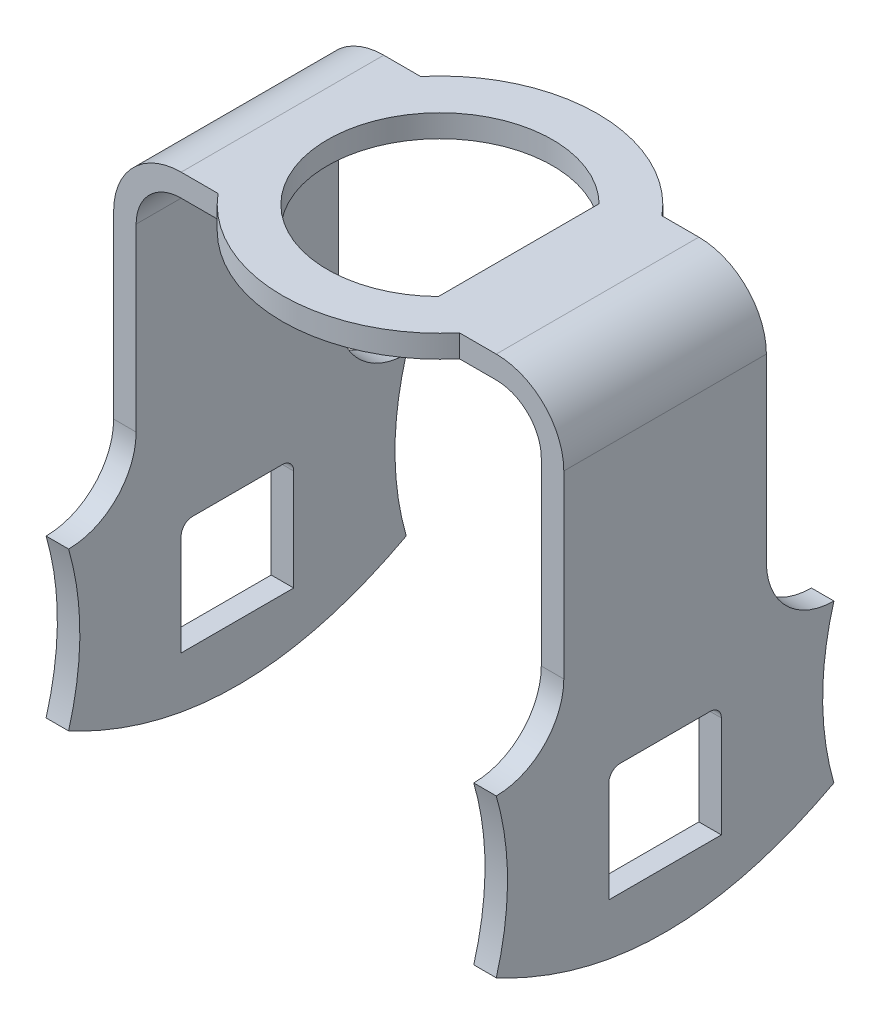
ISO-10303-21;
HEADER;
FILE_DESCRIPTION(('STEP AP214'),'2;1');
FILE_NAME('part.step','',(''),(''),'','','');
FILE_SCHEMA(('AUTOMOTIVE_DESIGN { 1 0 10303 214 1 1 1 1 }'));
ENDSEC;
DATA;
#1=APPLICATION_CONTEXT('core data for automotive mechanical design processes');
#2=APPLICATION_PROTOCOL_DEFINITION('international standard','automotive_design',2000,#1);
#3=PRODUCT_CONTEXT('',#1,'mechanical');
#4=PRODUCT('Part','Part','',(#3));
#5=PRODUCT_RELATED_PRODUCT_CATEGORY('part','',(#4));
#6=PRODUCT_DEFINITION_FORMATION('','',#4);
#7=PRODUCT_DEFINITION_CONTEXT('part definition',#1,'design');
#8=PRODUCT_DEFINITION('design','',#6,#7);
#9=PRODUCT_DEFINITION_SHAPE('','',#8);
#10=(LENGTH_UNIT() NAMED_UNIT(*) SI_UNIT(.MILLI.,.METRE.));
#11=(NAMED_UNIT(*) PLANE_ANGLE_UNIT() SI_UNIT($,.RADIAN.));
#12=(NAMED_UNIT(*) SI_UNIT($,.STERADIAN.) SOLID_ANGLE_UNIT());
#13=UNCERTAINTY_MEASURE_WITH_UNIT(LENGTH_MEASURE(1.E-05),#10,'distance_accuracy_value','');
#14=(GEOMETRIC_REPRESENTATION_CONTEXT(3) GLOBAL_UNCERTAINTY_ASSIGNED_CONTEXT((#13)) GLOBAL_UNIT_ASSIGNED_CONTEXT((#10,
#11,#12)) REPRESENTATION_CONTEXT('',''));
#15=CARTESIAN_POINT('',(0.,0.,0.));
#16=DIRECTION('',(0.,0.,1.));
#17=DIRECTION('',(1.,0.,0.));
#18=AXIS2_PLACEMENT_3D('',#15,#16,#17);
#19=CARTESIAN_POINT('',(0.,0.,15.));
#20=DIRECTION('',(-1.,0.,0.));
#21=DIRECTION('',(0.,0.,1.));
#22=AXIS2_PLACEMENT_3D('',#19,#20,#21);
#23=PLANE('',#22);
#24=DIRECTION('',(0.,1.,0.));
#25=VECTOR('',#24,1.);
#26=CARTESIAN_POINT('',(0.,0.,10.0000000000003));
#27=LINE('',#26,#25);
#28=CARTESIAN_POINT('',(0.,2.5,10.0000000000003));
#29=VERTEX_POINT('',#28);
#30=CARTESIAN_POINT('',(0.,7.,10.0000000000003));
#31=VERTEX_POINT('',#30);
#32=EDGE_CURVE('E371',#29,#31,#27,.T.);
#33=ORIENTED_EDGE('',*,*,#32,.T.);
#34=CARTESIAN_POINT('',(0.,7.,9.50000000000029));
#35=DIRECTION('',(-1.,0.,0.));
#36=DIRECTION('',(0.,0.,1.));
#37=AXIS2_PLACEMENT_3D('',#34,#35,#36);
#38=CIRCLE('',#37,0.5);
#39=CARTESIAN_POINT('',(0.,7.5,9.50000000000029));
#40=VERTEX_POINT('',#39);
#41=EDGE_CURVE('E565',#31,#40,#38,.T.);
#42=ORIENTED_EDGE('',*,*,#41,.T.);
#43=DIRECTION('',(0.,0.,-1.));
#44=VECTOR('',#43,1.);
#45=CARTESIAN_POINT('',(0.,7.5,15.));
#46=LINE('',#45,#44);
#47=CARTESIAN_POINT('',(0.,7.5,5.50000000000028));
#48=VERTEX_POINT('',#47);
#49=EDGE_CURVE('E376',#40,#48,#46,.T.);
#50=ORIENTED_EDGE('',*,*,#49,.T.);
#51=CARTESIAN_POINT('',(0.,7.,5.50000000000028));
#52=DIRECTION('',(-1.,0.,0.));
#53=DIRECTION('',(0.,0.,1.));
#54=AXIS2_PLACEMENT_3D('',#51,#52,#53);
#55=CIRCLE('',#54,0.5);
#56=CARTESIAN_POINT('',(0.,7.,5.00000000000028));
#57=VERTEX_POINT('',#56);
#58=EDGE_CURVE('E569',#48,#57,#55,.T.);
#59=ORIENTED_EDGE('',*,*,#58,.T.);
#60=DIRECTION('',(0.,-1.,0.));
#61=VECTOR('',#60,1.);
#62=CARTESIAN_POINT('',(0.,0.,5.00000000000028));
#63=LINE('',#62,#61);
#64=CARTESIAN_POINT('',(0.,2.5,5.00000000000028));
#65=VERTEX_POINT('',#64);
#66=EDGE_CURVE('E381',#57,#65,#63,.T.);
#67=ORIENTED_EDGE('',*,*,#66,.T.);
#68=DIRECTION('',(0.,0.,1.));
#69=VECTOR('',#68,1.);
#70=CARTESIAN_POINT('',(0.,2.5,15.));
#71=LINE('',#70,#69);
#72=EDGE_CURVE('E367',#65,#29,#71,.T.);
#73=ORIENTED_EDGE('',*,*,#72,.T.);
#74=EDGE_LOOP('',(#33,#42,#50,#59,#67,#73));
#75=FACE_BOUND('',#74,.T.);
#76=CARTESIAN_POINT('',(0.,9.,0.));
#77=CARTESIAN_POINT('',(0.,5.5,1.));
#78=CARTESIAN_POINT('',(0.,2.,0.));
#79=B_SPLINE_CURVE_WITH_KNOTS('',2,(#76,#77,#78),.UNSPECIFIED.,.F.,.F.,(3,3),(0.,1.),.UNSPECIFIED.);
#80=CARTESIAN_POINT('',(0.,9.,0.));
#81=VERTEX_POINT('',#80);
#82=CARTESIAN_POINT('',(0.,2.,0.));
#83=VERTEX_POINT('',#82);
#84=EDGE_CURVE('E383',#81,#83,#79,.T.);
#85=ORIENTED_EDGE('',*,*,#84,.F.);
#86=CARTESIAN_POINT('',(0.,12.,0.));
#87=DIRECTION('',(-1.,0.,0.));
#88=DIRECTION('',(0.,0.,1.));
#89=AXIS2_PLACEMENT_3D('',#86,#87,#88);
#90=CIRCLE('',#89,3.);
#91=CARTESIAN_POINT('',(0.,12.,3.));
#92=VERTEX_POINT('',#91);
#93=EDGE_CURVE('E515',#81,#92,#90,.T.);
#94=ORIENTED_EDGE('',*,*,#93,.T.);
#95=DIRECTION('',(0.,1.,0.));
#96=VECTOR('',#95,1.);
#97=CARTESIAN_POINT('',(0.,9.,3.));
#98=LINE('',#97,#96);
#99=CARTESIAN_POINT('',(0.,20.,3.));
#100=VERTEX_POINT('',#99);
#101=EDGE_CURVE('E766',#92,#100,#98,.T.);
#102=ORIENTED_EDGE('',*,*,#101,.T.);
#103=DIRECTION('',(0.,0.,-1.));
#104=VECTOR('',#103,1.);
#105=CARTESIAN_POINT('',(0.,20.,15.));
#106=LINE('',#105,#104);
#107=CARTESIAN_POINT('',(0.,20.,12.));
#108=VERTEX_POINT('',#107);
#109=EDGE_CURVE('E815',#108,#100,#106,.T.);
#110=ORIENTED_EDGE('',*,*,#109,.F.);
#111=DIRECTION('',(0.,1.,0.));
#112=VECTOR('',#111,1.);
#113=CARTESIAN_POINT('',(0.,9.,12.));
#114=LINE('',#113,#112);
#115=CARTESIAN_POINT('',(0.,12.,12.));
#116=VERTEX_POINT('',#115);
#117=EDGE_CURVE('E738',#116,#108,#114,.T.);
#118=ORIENTED_EDGE('',*,*,#117,.F.);
#119=CARTESIAN_POINT('',(0.,12.,15.));
#120=DIRECTION('',(-1.,0.,0.));
#121=DIRECTION('',(0.,0.,1.));
#122=AXIS2_PLACEMENT_3D('',#119,#120,#121);
#123=CIRCLE('',#122,3.);
#124=CARTESIAN_POINT('',(0.,9.,15.0000000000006));
#125=VERTEX_POINT('',#124);
#126=EDGE_CURVE('E523',#116,#125,#123,.T.);
#127=ORIENTED_EDGE('',*,*,#126,.T.);
#128=CARTESIAN_POINT('',(0.,9.,15.0000000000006));
#129=CARTESIAN_POINT('',(0.,5.5,14.0000000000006));
#130=CARTESIAN_POINT('',(0.,1.99999999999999,15.0000000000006));
#131=B_SPLINE_CURVE_WITH_KNOTS('',2,(#128,#129,#130),.UNSPECIFIED.,.F.,.F.,(3,3),(0.,1.),.UNSPECIFIED.);
#132=CARTESIAN_POINT('',(0.,1.99999999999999,15.0000000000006));
#133=VERTEX_POINT('',#132);
#134=EDGE_CURVE('E419',#125,#133,#131,.T.);
#135=ORIENTED_EDGE('',*,*,#134,.T.);
#136=CARTESIAN_POINT('',(0.,2.,0.));
#137=CARTESIAN_POINT('',(0.,-2.,7.5));
#138=CARTESIAN_POINT('',(0.,2.,15.));
#139=B_SPLINE_CURVE_WITH_KNOTS('',2,(#136,#137,#138),.UNSPECIFIED.,.F.,.F.,(3,3),(0.,1.),.UNSPECIFIED.);
#140=EDGE_CURVE('E458',#83,#133,#139,.T.);
#141=ORIENTED_EDGE('',*,*,#140,.F.);
#142=EDGE_LOOP('',(#85,#94,#102,#110,#118,#127,#135,#141));
#143=FACE_BOUND('',#142,.T.);
#144=ADVANCED_FACE('F86',(#75,#143),#23,.F.);
#145=CARTESIAN_POINT('',(-20.,0.,15.));
#146=DIRECTION('',(1.,0.,0.));
#147=DIRECTION('',(0.,1.,0.));
#148=AXIS2_PLACEMENT_3D('',#145,#146,#147);
#149=PLANE('',#148);
#150=DIRECTION('',(0.,0.,1.));
#151=VECTOR('',#150,1.);
#152=CARTESIAN_POINT('',(-20.,2.5,5.00000000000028));
#153=LINE('',#152,#151);
#154=CARTESIAN_POINT('',(-20.,2.5,5.00000000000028));
#155=VERTEX_POINT('',#154);
#156=CARTESIAN_POINT('',(-20.,2.5,10.0000000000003));
#157=VERTEX_POINT('',#156);
#158=EDGE_CURVE('E346',#155,#157,#153,.T.);
#159=ORIENTED_EDGE('',*,*,#158,.F.);
#160=DIRECTION('',(0.,-1.,0.));
#161=VECTOR('',#160,1.);
#162=CARTESIAN_POINT('',(-20.,7.5,5.00000000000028));
#163=LINE('',#162,#161);
#164=CARTESIAN_POINT('',(-20.,7.,5.00000000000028));
#165=VERTEX_POINT('',#164);
#166=EDGE_CURVE('E352',#165,#155,#163,.T.);
#167=ORIENTED_EDGE('',*,*,#166,.F.);
#168=CARTESIAN_POINT('',(-20.,7.,5.50000000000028));
#169=DIRECTION('',(1.,0.,0.));
#170=DIRECTION('',(0.,1.,0.));
#171=AXIS2_PLACEMENT_3D('',#168,#169,#170);
#172=CIRCLE('',#171,0.5);
#173=CARTESIAN_POINT('',(-20.,7.5,5.50000000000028));
#174=VERTEX_POINT('',#173);
#175=EDGE_CURVE('E94',#165,#174,#172,.T.);
#176=ORIENTED_EDGE('',*,*,#175,.T.);
#177=DIRECTION('',(0.,0.,-1.));
#178=VECTOR('',#177,1.);
#179=CARTESIAN_POINT('',(-20.,7.5,5.00000000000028));
#180=LINE('',#179,#178);
#181=CARTESIAN_POINT('',(-20.,7.5,9.50000000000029));
#182=VERTEX_POINT('',#181);
#183=EDGE_CURVE('E358',#182,#174,#180,.T.);
#184=ORIENTED_EDGE('',*,*,#183,.F.);
#185=CARTESIAN_POINT('',(-20.,7.,9.50000000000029));
#186=DIRECTION('',(1.,0.,0.));
#187=DIRECTION('',(0.,1.,0.));
#188=AXIS2_PLACEMENT_3D('',#185,#186,#187);
#189=CIRCLE('',#188,0.5);
#190=CARTESIAN_POINT('',(-20.,7.,10.0000000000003));
#191=VERTEX_POINT('',#190);
#192=EDGE_CURVE('E357',#182,#191,#189,.T.);
#193=ORIENTED_EDGE('',*,*,#192,.T.);
#194=DIRECTION('',(0.,1.,0.));
#195=VECTOR('',#194,1.);
#196=CARTESIAN_POINT('',(-20.,7.5,10.0000000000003));
#197=LINE('',#196,#195);
#198=EDGE_CURVE('E334',#157,#191,#197,.T.);
#199=ORIENTED_EDGE('',*,*,#198,.F.);
#200=EDGE_LOOP('',(#159,#167,#176,#184,#193,#199));
#201=FACE_BOUND('',#200,.T.);
#202=CARTESIAN_POINT('',(-20.,9.,0.));
#203=CARTESIAN_POINT('',(-20.,5.5,1.));
#204=CARTESIAN_POINT('',(-20.,2.,0.));
#205=B_SPLINE_CURVE_WITH_KNOTS('',2,(#202,#203,#204),.UNSPECIFIED.,.F.,.F.,(3,3),(0.,1.),.UNSPECIFIED.);
#206=CARTESIAN_POINT('',(-20.,9.,0.));
#207=VERTEX_POINT('',#206);
#208=CARTESIAN_POINT('',(-20.,2.,0.));
#209=VERTEX_POINT('',#208);
#210=EDGE_CURVE('E386',#207,#209,#205,.T.);
#211=ORIENTED_EDGE('',*,*,#210,.T.);
#212=CARTESIAN_POINT('',(-20.,2.,0.));
#213=CARTESIAN_POINT('',(-20.,-2.00000000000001,7.5));
#214=CARTESIAN_POINT('',(-20.,2.,15.));
#215=B_SPLINE_CURVE_WITH_KNOTS('',2,(#212,#213,#214),.UNSPECIFIED.,.F.,.F.,(3,3),(0.,1.),.UNSPECIFIED.);
#216=CARTESIAN_POINT('',(-20.,2.,15.));
#217=VERTEX_POINT('',#216);
#218=EDGE_CURVE('E468',#209,#217,#215,.T.);
#219=ORIENTED_EDGE('',*,*,#218,.T.);
#220=CARTESIAN_POINT('',(-20.,9.,15.0000000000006));
#221=CARTESIAN_POINT('',(-20.,5.5,14.0000000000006));
#222=CARTESIAN_POINT('',(-20.,1.99999999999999,15.0000000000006));
#223=B_SPLINE_CURVE_WITH_KNOTS('',2,(#220,#221,#222),.UNSPECIFIED.,.F.,.F.,(3,3),(0.,1.),.UNSPECIFIED.);
#224=CARTESIAN_POINT('',(-20.,9.,15.0000000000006));
#225=VERTEX_POINT('',#224);
#226=EDGE_CURVE('E427',#225,#217,#223,.T.);
#227=ORIENTED_EDGE('',*,*,#226,.F.);
#228=CARTESIAN_POINT('',(-20.,12.,15.));
#229=DIRECTION('',(1.,0.,0.));
#230=DIRECTION('',(0.,1.,0.));
#231=AXIS2_PLACEMENT_3D('',#228,#229,#230);
#232=CIRCLE('',#231,3.);
#233=CARTESIAN_POINT('',(-20.,12.,12.));
#234=VERTEX_POINT('',#233);
#235=EDGE_CURVE('E527',#225,#234,#232,.T.);
#236=ORIENTED_EDGE('',*,*,#235,.T.);
#237=DIRECTION('',(0.,1.,0.));
#238=VECTOR('',#237,1.);
#239=CARTESIAN_POINT('',(-20.,9.,12.));
#240=LINE('',#239,#238);
#241=CARTESIAN_POINT('',(-20.,20.,12.));
#242=VERTEX_POINT('',#241);
#243=EDGE_CURVE('E725',#234,#242,#240,.T.);
#244=ORIENTED_EDGE('',*,*,#243,.T.);
#245=DIRECTION('',(0.,0.,-1.));
#246=VECTOR('',#245,1.);
#247=CARTESIAN_POINT('',(-20.,20.,15.));
#248=LINE('',#247,#246);
#249=CARTESIAN_POINT('',(-20.,20.,3.));
#250=VERTEX_POINT('',#249);
#251=EDGE_CURVE('E808',#242,#250,#248,.T.);
#252=ORIENTED_EDGE('',*,*,#251,.T.);
#253=DIRECTION('',(0.,1.,0.));
#254=VECTOR('',#253,1.);
#255=CARTESIAN_POINT('',(-20.,9.,3.));
#256=LINE('',#255,#254);
#257=CARTESIAN_POINT('',(-20.,12.,3.));
#258=VERTEX_POINT('',#257);
#259=EDGE_CURVE('E496',#258,#250,#256,.T.);
#260=ORIENTED_EDGE('',*,*,#259,.F.);
#261=CARTESIAN_POINT('',(-20.,12.,0.));
#262=DIRECTION('',(1.,0.,0.));
#263=DIRECTION('',(0.,1.,0.));
#264=AXIS2_PLACEMENT_3D('',#261,#262,#263);
#265=CIRCLE('',#264,3.);
#266=EDGE_CURVE('E505',#258,#207,#265,.T.);
#267=ORIENTED_EDGE('',*,*,#266,.T.);
#268=EDGE_LOOP('',(#211,#219,#227,#236,#244,#252,#260,#267));
#269=FACE_BOUND('',#268,.T.);
#270=ADVANCED_FACE('F354',(#201,#269),#149,.F.);
#271=CARTESIAN_POINT('',(-19.,0.,15.));
#272=DIRECTION('',(-1.,0.,0.));
#273=DIRECTION('',(0.,0.,1.));
#274=AXIS2_PLACEMENT_3D('',#271,#272,#273);
#275=PLANE('',#274);
#276=DIRECTION('',(0.,1.,0.));
#277=VECTOR('',#276,1.);
#278=CARTESIAN_POINT('',(-19.,0.,10.0000000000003));
#279=LINE('',#278,#277);
#280=CARTESIAN_POINT('',(-19.,2.5,10.0000000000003));
#281=VERTEX_POINT('',#280);
#282=CARTESIAN_POINT('',(-19.,7.,10.0000000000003));
#283=VERTEX_POINT('',#282);
#284=EDGE_CURVE('E337',#281,#283,#279,.T.);
#285=ORIENTED_EDGE('',*,*,#284,.T.);
#286=CARTESIAN_POINT('',(-19.,7.,9.50000000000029));
#287=DIRECTION('',(-1.,0.,0.));
#288=DIRECTION('',(0.,0.,1.));
#289=AXIS2_PLACEMENT_3D('',#286,#287,#288);
#290=CIRCLE('',#289,0.5);
#291=CARTESIAN_POINT('',(-19.,7.5,9.50000000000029));
#292=VERTEX_POINT('',#291);
#293=EDGE_CURVE('E572',#283,#292,#290,.T.);
#294=ORIENTED_EDGE('',*,*,#293,.T.);
#295=DIRECTION('',(0.,0.,-1.));
#296=VECTOR('',#295,1.);
#297=CARTESIAN_POINT('',(-19.,7.5,15.));
#298=LINE('',#297,#296);
#299=CARTESIAN_POINT('',(-19.,7.5,5.50000000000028));
#300=VERTEX_POINT('',#299);
#301=EDGE_CURVE('E374',#292,#300,#298,.T.);
#302=ORIENTED_EDGE('',*,*,#301,.T.);
#303=CARTESIAN_POINT('',(-19.,7.,5.50000000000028));
#304=DIRECTION('',(-1.,0.,0.));
#305=DIRECTION('',(0.,0.,1.));
#306=AXIS2_PLACEMENT_3D('',#303,#304,#305);
#307=CIRCLE('',#306,0.5);
#308=CARTESIAN_POINT('',(-19.,7.,5.00000000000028));
#309=VERTEX_POINT('',#308);
#310=EDGE_CURVE('E12',#300,#309,#307,.T.);
#311=ORIENTED_EDGE('',*,*,#310,.T.);
#312=DIRECTION('',(0.,-1.,0.));
#313=VECTOR('',#312,1.);
#314=CARTESIAN_POINT('',(-19.,0.,5.00000000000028));
#315=LINE('',#314,#313);
#316=CARTESIAN_POINT('',(-19.,2.5,5.00000000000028));
#317=VERTEX_POINT('',#316);
#318=EDGE_CURVE('E379',#309,#317,#315,.T.);
#319=ORIENTED_EDGE('',*,*,#318,.T.);
#320=DIRECTION('',(0.,0.,1.));
#321=VECTOR('',#320,1.);
#322=CARTESIAN_POINT('',(-19.,2.5,15.));
#323=LINE('',#322,#321);
#324=EDGE_CURVE('E365',#317,#281,#323,.T.);
#325=ORIENTED_EDGE('',*,*,#324,.T.);
#326=EDGE_LOOP('',(#285,#294,#302,#311,#319,#325));
#327=FACE_BOUND('',#326,.T.);
#328=CARTESIAN_POINT('',(-19.,9.,0.));
#329=CARTESIAN_POINT('',(-19.,5.5,1.));
#330=CARTESIAN_POINT('',(-19.,2.,0.));
#331=B_SPLINE_CURVE_WITH_KNOTS('',2,(#328,#329,#330),.UNSPECIFIED.,.F.,.F.,(3,3),(0.,1.),.UNSPECIFIED.);
#332=CARTESIAN_POINT('',(-19.,9.,0.));
#333=VERTEX_POINT('',#332);
#334=CARTESIAN_POINT('',(-19.,2.,0.));
#335=VERTEX_POINT('',#334);
#336=EDGE_CURVE('E438',#333,#335,#331,.T.);
#337=ORIENTED_EDGE('',*,*,#336,.F.);
#338=CARTESIAN_POINT('',(-19.,12.,0.));
#339=DIRECTION('',(-1.,0.,0.));
#340=DIRECTION('',(0.,0.,1.));
#341=AXIS2_PLACEMENT_3D('',#338,#339,#340);
#342=CIRCLE('',#341,3.);
#343=CARTESIAN_POINT('',(-19.,12.,3.));
#344=VERTEX_POINT('',#343);
#345=EDGE_CURVE('E502',#333,#344,#342,.T.);
#346=ORIENTED_EDGE('',*,*,#345,.T.);
#347=DIRECTION('',(0.,1.,0.));
#348=VECTOR('',#347,1.);
#349=CARTESIAN_POINT('',(-19.,0.,3.));
#350=LINE('',#349,#348);
#351=CARTESIAN_POINT('',(-19.,20.,3.));
#352=VERTEX_POINT('',#351);
#353=EDGE_CURVE('E784',#344,#352,#350,.T.);
#354=ORIENTED_EDGE('',*,*,#353,.T.);
#355=DIRECTION('',(0.,0.,-1.));
#356=VECTOR('',#355,1.);
#357=CARTESIAN_POINT('',(-19.,20.,15.));
#358=LINE('',#357,#356);
#359=CARTESIAN_POINT('',(-19.,20.,12.));
#360=VERTEX_POINT('',#359);
#361=EDGE_CURVE('E805',#360,#352,#358,.T.);
#362=ORIENTED_EDGE('',*,*,#361,.F.);
#363=DIRECTION('',(0.,-1.,0.));
#364=VECTOR('',#363,1.);
#365=CARTESIAN_POINT('',(-19.,0.,12.));
#366=LINE('',#365,#364);
#367=CARTESIAN_POINT('',(-19.,12.,12.));
#368=VERTEX_POINT('',#367);
#369=EDGE_CURVE('E752',#360,#368,#366,.T.);
#370=ORIENTED_EDGE('',*,*,#369,.T.);
#371=CARTESIAN_POINT('',(-19.,12.,15.));
#372=DIRECTION('',(-1.,0.,0.));
#373=DIRECTION('',(0.,0.,1.));
#374=AXIS2_PLACEMENT_3D('',#371,#372,#373);
#375=CIRCLE('',#374,3.);
#376=CARTESIAN_POINT('',(-19.,9.,15.0000000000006));
#377=VERTEX_POINT('',#376);
#378=EDGE_CURVE('E529',#368,#377,#375,.T.);
#379=ORIENTED_EDGE('',*,*,#378,.T.);
#380=CARTESIAN_POINT('',(-19.,9.,15.0000000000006));
#381=CARTESIAN_POINT('',(-19.,5.5,14.0000000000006));
#382=CARTESIAN_POINT('',(-19.,1.99999999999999,15.0000000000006));
#383=B_SPLINE_CURVE_WITH_KNOTS('',2,(#380,#381,#382),.UNSPECIFIED.,.F.,.F.,(3,3),(0.,1.),.UNSPECIFIED.);
#384=CARTESIAN_POINT('',(-19.,1.99999999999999,15.0000000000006));
#385=VERTEX_POINT('',#384);
#386=EDGE_CURVE('E444',#377,#385,#383,.T.);
#387=ORIENTED_EDGE('',*,*,#386,.T.);
#388=CARTESIAN_POINT('',(-19.,2.,0.));
#389=CARTESIAN_POINT('',(-19.,-2.00000000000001,7.5));
#390=CARTESIAN_POINT('',(-19.,2.,15.));
#391=B_SPLINE_CURVE_WITH_KNOTS('',2,(#388,#389,#390),.UNSPECIFIED.,.F.,.F.,(3,3),(0.,1.),.UNSPECIFIED.);
#392=EDGE_CURVE('E667',#335,#385,#391,.T.);
#393=ORIENTED_EDGE('',*,*,#392,.F.);
#394=EDGE_LOOP('',(#337,#346,#354,#362,#370,#379,#387,#393));
#395=FACE_BOUND('',#394,.T.);
#396=ADVANCED_FACE('F579',(#327,#395),#275,.F.);
#397=CARTESIAN_POINT('',(-1.,0.,15.));
#398=DIRECTION('',(1.,0.,0.));
#399=DIRECTION('',(0.,1.,0.));
#400=AXIS2_PLACEMENT_3D('',#397,#398,#399);
#401=PLANE('',#400);
#402=DIRECTION('',(0.,0.,-1.));
#403=VECTOR('',#402,1.);
#404=CARTESIAN_POINT('',(-1.,2.5,15.));
#405=LINE('',#404,#403);
#406=CARTESIAN_POINT('',(-1.,2.5,10.0000000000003));
#407=VERTEX_POINT('',#406);
#408=CARTESIAN_POINT('',(-1.,2.5,5.00000000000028));
#409=VERTEX_POINT('',#408);
#410=EDGE_CURVE('E531',#407,#409,#405,.T.);
#411=ORIENTED_EDGE('',*,*,#410,.T.);
#412=DIRECTION('',(0.,1.,0.));
#413=VECTOR('',#412,1.);
#414=CARTESIAN_POINT('',(-1.,0.,5.00000000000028));
#415=LINE('',#414,#413);
#416=CARTESIAN_POINT('',(-1.,7.,5.00000000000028));
#417=VERTEX_POINT('',#416);
#418=EDGE_CURVE('E541',#409,#417,#415,.T.);
#419=ORIENTED_EDGE('',*,*,#418,.T.);
#420=CARTESIAN_POINT('',(-1.,7.,5.50000000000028));
#421=DIRECTION('',(1.,0.,0.));
#422=DIRECTION('',(0.,1.,0.));
#423=AXIS2_PLACEMENT_3D('',#420,#421,#422);
#424=CIRCLE('',#423,0.5);
#425=CARTESIAN_POINT('',(-1.,7.5,5.50000000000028));
#426=VERTEX_POINT('',#425);
#427=EDGE_CURVE('E567',#417,#426,#424,.T.);
#428=ORIENTED_EDGE('',*,*,#427,.T.);
#429=DIRECTION('',(0.,0.,1.));
#430=VECTOR('',#429,1.);
#431=CARTESIAN_POINT('',(-1.,7.5,15.));
#432=LINE('',#431,#430);
#433=CARTESIAN_POINT('',(-1.,7.5,9.50000000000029));
#434=VERTEX_POINT('',#433);
#435=EDGE_CURVE('E538',#426,#434,#432,.T.);
#436=ORIENTED_EDGE('',*,*,#435,.T.);
#437=CARTESIAN_POINT('',(-1.,7.,9.50000000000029));
#438=DIRECTION('',(1.,0.,0.));
#439=DIRECTION('',(0.,1.,0.));
#440=AXIS2_PLACEMENT_3D('',#437,#438,#439);
#441=CIRCLE('',#440,0.5);
#442=CARTESIAN_POINT('',(-1.,7.,10.0000000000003));
#443=VERTEX_POINT('',#442);
#444=EDGE_CURVE('E563',#434,#443,#441,.T.);
#445=ORIENTED_EDGE('',*,*,#444,.T.);
#446=DIRECTION('',(0.,-1.,0.));
#447=VECTOR('',#446,1.);
#448=CARTESIAN_POINT('',(-1.,0.,10.0000000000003));
#449=LINE('',#448,#447);
#450=EDGE_CURVE('E536',#443,#407,#449,.T.);
#451=ORIENTED_EDGE('',*,*,#450,.T.);
#452=EDGE_LOOP('',(#411,#419,#428,#436,#445,#451));
#453=FACE_BOUND('',#452,.T.);
#454=CARTESIAN_POINT('',(-1.,9.,0.));
#455=CARTESIAN_POINT('',(-1.,5.5,1.));
#456=CARTESIAN_POINT('',(-1.,2.,0.));
#457=B_SPLINE_CURVE_WITH_KNOTS('',2,(#454,#455,#456),.UNSPECIFIED.,.F.,.F.,(3,3),(0.,1.),.UNSPECIFIED.);
#458=CARTESIAN_POINT('',(-1.,2.,0.));
#459=VERTEX_POINT('',#458);
#460=CARTESIAN_POINT('',(-1.,9.,0.));
#461=VERTEX_POINT('',#460);
#462=EDGE_CURVE('E395',#459,#461,#457,.F.);
#463=ORIENTED_EDGE('',*,*,#462,.F.);
#464=CARTESIAN_POINT('',(-1.,2.,0.));
#465=CARTESIAN_POINT('',(-1.,-2.,7.5));
#466=CARTESIAN_POINT('',(-1.,2.,15.));
#467=B_SPLINE_CURVE_WITH_KNOTS('',2,(#464,#465,#466),.UNSPECIFIED.,.F.,.F.,(3,3),(0.,1.),.UNSPECIFIED.);
#468=CARTESIAN_POINT('',(-1.,2.,15.));
#469=VERTEX_POINT('',#468);
#470=EDGE_CURVE('E491',#469,#459,#467,.F.);
#471=ORIENTED_EDGE('',*,*,#470,.F.);
#472=CARTESIAN_POINT('',(-1.,9.,15.0000000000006));
#473=CARTESIAN_POINT('',(-1.,5.5,14.0000000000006));
#474=CARTESIAN_POINT('',(-1.,1.99999999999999,15.0000000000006));
#475=B_SPLINE_CURVE_WITH_KNOTS('',2,(#472,#473,#474),.UNSPECIFIED.,.F.,.F.,(3,3),(0.,1.),.UNSPECIFIED.);
#476=CARTESIAN_POINT('',(-1.,9.,15.0000000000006));
#477=VERTEX_POINT('',#476);
#478=EDGE_CURVE('E426',#469,#477,#475,.F.);
#479=ORIENTED_EDGE('',*,*,#478,.T.);
#480=CARTESIAN_POINT('',(-0.999999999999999,12.,15.));
#481=DIRECTION('',(1.,0.,0.));
#482=DIRECTION('',(0.,1.,0.));
#483=AXIS2_PLACEMENT_3D('',#480,#481,#482);
#484=CIRCLE('',#483,3.);
#485=CARTESIAN_POINT('',(-1.,12.,12.));
#486=VERTEX_POINT('',#485);
#487=EDGE_CURVE('E519',#477,#486,#484,.T.);
#488=ORIENTED_EDGE('',*,*,#487,.T.);
#489=DIRECTION('',(0.,1.,0.));
#490=VECTOR('',#489,1.);
#491=CARTESIAN_POINT('',(-1.,0.,12.));
#492=LINE('',#491,#490);
#493=CARTESIAN_POINT('',(-1.,20.,12.));
#494=VERTEX_POINT('',#493);
#495=EDGE_CURVE('E687',#486,#494,#492,.T.);
#496=ORIENTED_EDGE('',*,*,#495,.T.);
#497=DIRECTION('',(0.,0.,-1.));
#498=VECTOR('',#497,1.);
#499=CARTESIAN_POINT('',(-1.,20.,15.));
#500=LINE('',#499,#498);
#501=CARTESIAN_POINT('',(-1.,20.,3.));
#502=VERTEX_POINT('',#501);
#503=EDGE_CURVE('E797',#494,#502,#500,.T.);
#504=ORIENTED_EDGE('',*,*,#503,.T.);
#505=DIRECTION('',(0.,-1.,0.));
#506=VECTOR('',#505,1.);
#507=CARTESIAN_POINT('',(-1.,0.,3.));
#508=LINE('',#507,#506);
#509=CARTESIAN_POINT('',(-1.,12.,3.));
#510=VERTEX_POINT('',#509);
#511=EDGE_CURVE('E701',#502,#510,#508,.T.);
#512=ORIENTED_EDGE('',*,*,#511,.T.);
#513=CARTESIAN_POINT('',(-0.999999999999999,12.,0.));
#514=DIRECTION('',(1.,0.,0.));
#515=DIRECTION('',(0.,1.,0.));
#516=AXIS2_PLACEMENT_3D('',#513,#514,#515);
#517=CIRCLE('',#516,3.);
#518=EDGE_CURVE('E517',#510,#461,#517,.T.);
#519=ORIENTED_EDGE('',*,*,#518,.T.);
#520=EDGE_LOOP('',(#463,#471,#479,#488,#496,#504,#512,#519));
#521=FACE_BOUND('',#520,.T.);
#522=ADVANCED_FACE('F650',(#453,#521),#401,.F.);
#523=CARTESIAN_POINT('',(-3.,20.,15.));
#524=DIRECTION('',(0.,0.,-1.));
#525=DIRECTION('',(-1.,0.,0.));
#526=AXIS2_PLACEMENT_3D('',#523,#524,#525);
#527=CYLINDRICAL_SURFACE('',#526,3.);
#528=DIRECTION('',(0.,0.,-1.));
#529=VECTOR('',#528,1.);
#530=CARTESIAN_POINT('',(-3.00000000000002,23.,15.));
#531=LINE('',#530,#529);
#532=CARTESIAN_POINT('',(-3.00000000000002,23.,12.));
#533=VERTEX_POINT('',#532);
#534=CARTESIAN_POINT('',(-3.00000000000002,23.,3.));
#535=VERTEX_POINT('',#534);
#536=EDGE_CURVE('E813',#533,#535,#531,.T.);
#537=ORIENTED_EDGE('',*,*,#536,.F.);
#538=CARTESIAN_POINT('',(-3.,20.,12.));
#539=DIRECTION('',(0.,0.,-1.));
#540=DIRECTION('',(-1.,0.,0.));
#541=AXIS2_PLACEMENT_3D('',#538,#539,#540);
#542=CIRCLE('',#541,3.);
#543=EDGE_CURVE('E746',#533,#108,#542,.T.);
#544=ORIENTED_EDGE('',*,*,#543,.T.);
#545=ORIENTED_EDGE('',*,*,#109,.T.);
#546=CARTESIAN_POINT('',(-3.,20.,3.));
#547=DIRECTION('',(0.,0.,1.));
#548=DIRECTION('',(1.,0.,0.));
#549=AXIS2_PLACEMENT_3D('',#546,#547,#548);
#550=CIRCLE('',#549,3.);
#551=EDGE_CURVE('E778',#100,#535,#550,.T.);
#552=ORIENTED_EDGE('',*,*,#551,.T.);
#553=EDGE_LOOP('',(#537,#544,#545,#552));
#554=FACE_BOUND('',#553,.T.);
#555=ADVANCED_FACE('F603',(#554),#527,.T.);
#556=CARTESIAN_POINT('',(-3.00000000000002,23.,15.));
#557=DIRECTION('',(0.,-1.,0.));
#558=DIRECTION('',(0.,0.,-1.));
#559=AXIS2_PLACEMENT_3D('',#556,#557,#558);
#560=PLANE('',#559);
#561=DIRECTION('',(0.,0.,-1.));
#562=VECTOR('',#561,1.);
#563=CARTESIAN_POINT('',(-6.50000000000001,23.,11.0707142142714));
#564=LINE('',#563,#562);
#565=CARTESIAN_POINT('',(-6.50000000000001,23.,11.0707142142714));
#566=VERTEX_POINT('',#565);
#567=CARTESIAN_POINT('',(-6.50000000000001,23.,3.92928578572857));
#568=VERTEX_POINT('',#567);
#569=EDGE_CURVE('E791',#566,#568,#564,.T.);
#570=ORIENTED_EDGE('',*,*,#569,.F.);
#571=CARTESIAN_POINT('',(-10.,23.,7.5));
#572=DIRECTION('',(0.,1.,0.));
#573=DIRECTION('',(0.,0.,1.));
#574=AXIS2_PLACEMENT_3D('',#571,#572,#573);
#575=CIRCLE('',#574,5.);
#576=EDGE_CURVE('E789',#568,#566,#575,.T.);
#577=ORIENTED_EDGE('',*,*,#576,.F.);
#578=EDGE_LOOP('',(#570,#577));
#579=FACE_BOUND('',#578,.T.);
#580=CARTESIAN_POINT('',(-10.,23.,7.5));
#581=DIRECTION('',(0.,-1.,0.));
#582=DIRECTION('',(0.,0.,1.));
#583=AXIS2_PLACEMENT_3D('',#580,#581,#582);
#584=CIRCLE('',#583,7.);
#585=CARTESIAN_POINT('',(-4.6380973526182,23.,12.));
#586=VERTEX_POINT('',#585);
#587=CARTESIAN_POINT('',(-15.3619026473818,23.,12.));
#588=VERTEX_POINT('',#587);
#589=EDGE_CURVE('E481',#586,#588,#584,.T.);
#590=ORIENTED_EDGE('',*,*,#589,.F.);
#591=DIRECTION('',(-1.,0.,0.));
#592=VECTOR('',#591,1.);
#593=CARTESIAN_POINT('',(-4.6380973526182,23.,12.));
#594=LINE('',#593,#592);
#595=EDGE_CURVE('E722',#533,#586,#594,.T.);
#596=ORIENTED_EDGE('',*,*,#595,.F.);
#597=ORIENTED_EDGE('',*,*,#536,.T.);
#598=DIRECTION('',(1.,0.,0.));
#599=VECTOR('',#598,1.);
#600=CARTESIAN_POINT('',(-4.6380973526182,23.,3.));
#601=LINE('',#600,#599);
#602=CARTESIAN_POINT('',(-4.6380973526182,23.,3.));
#603=VERTEX_POINT('',#602);
#604=EDGE_CURVE('E497',#603,#535,#601,.T.);
#605=ORIENTED_EDGE('',*,*,#604,.F.);
#606=CARTESIAN_POINT('',(-10.,23.,7.5));
#607=DIRECTION('',(0.,-1.,0.));
#608=DIRECTION('',(0.,0.,1.));
#609=AXIS2_PLACEMENT_3D('',#606,#607,#608);
#610=CIRCLE('',#609,7.);
#611=CARTESIAN_POINT('',(-15.3619026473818,23.,3.));
#612=VERTEX_POINT('',#611);
#613=EDGE_CURVE('E761',#612,#603,#610,.T.);
#614=ORIENTED_EDGE('',*,*,#613,.F.);
#615=DIRECTION('',(1.,0.,0.));
#616=VECTOR('',#615,1.);
#617=CARTESIAN_POINT('',(-15.3619026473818,23.,3.));
#618=LINE('',#617,#616);
#619=CARTESIAN_POINT('',(-17.,23.,3.));
#620=VERTEX_POINT('',#619);
#621=EDGE_CURVE('E758',#620,#612,#618,.T.);
#622=ORIENTED_EDGE('',*,*,#621,.F.);
#623=DIRECTION('',(0.,0.,-1.));
#624=VECTOR('',#623,1.);
#625=CARTESIAN_POINT('',(-17.,23.,15.));
#626=LINE('',#625,#624);
#627=CARTESIAN_POINT('',(-17.,23.,12.));
#628=VERTEX_POINT('',#627);
#629=EDGE_CURVE('E811',#628,#620,#626,.T.);
#630=ORIENTED_EDGE('',*,*,#629,.F.);
#631=DIRECTION('',(-1.,0.,0.));
#632=VECTOR('',#631,1.);
#633=CARTESIAN_POINT('',(-15.3619026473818,23.,12.));
#634=LINE('',#633,#632);
#635=EDGE_CURVE('E728',#588,#628,#634,.T.);
#636=ORIENTED_EDGE('',*,*,#635,.F.);
#637=EDGE_LOOP('',(#590,#596,#597,#605,#614,#622,#630,#636));
#638=FACE_BOUND('',#637,.T.);
#639=ADVANCED_FACE('F884',(#579,#638),#560,.F.);
#640=CARTESIAN_POINT('',(-17.,20.,15.));
#641=DIRECTION('',(0.,0.,-1.));
#642=DIRECTION('',(-1.,0.,0.));
#643=AXIS2_PLACEMENT_3D('',#640,#641,#642);
#644=CYLINDRICAL_SURFACE('',#643,3.);
#645=ORIENTED_EDGE('',*,*,#251,.F.);
#646=CARTESIAN_POINT('',(-17.,20.,12.));
#647=DIRECTION('',(0.,0.,-1.));
#648=DIRECTION('',(-1.,0.,0.));
#649=AXIS2_PLACEMENT_3D('',#646,#647,#648);
#650=CIRCLE('',#649,3.);
#651=EDGE_CURVE('E755',#242,#628,#650,.T.);
#652=ORIENTED_EDGE('',*,*,#651,.T.);
#653=ORIENTED_EDGE('',*,*,#629,.T.);
#654=CARTESIAN_POINT('',(-17.,20.,3.));
#655=DIRECTION('',(0.,0.,1.));
#656=DIRECTION('',(1.,0.,0.));
#657=AXIS2_PLACEMENT_3D('',#654,#655,#656);
#658=CIRCLE('',#657,3.);
#659=EDGE_CURVE('E786',#620,#250,#658,.T.);
#660=ORIENTED_EDGE('',*,*,#659,.T.);
#661=EDGE_LOOP('',(#645,#652,#653,#660));
#662=FACE_BOUND('',#661,.T.);
#663=ADVANCED_FACE('F898',(#662),#644,.T.);
#664=CARTESIAN_POINT('',(-17.,20.,15.));
#665=DIRECTION('',(0.,0.,-1.));
#666=DIRECTION('',(-1.,0.,0.));
#667=AXIS2_PLACEMENT_3D('',#664,#665,#666);
#668=CYLINDRICAL_SURFACE('',#667,2.);
#669=DIRECTION('',(0.,0.,-1.));
#670=VECTOR('',#669,1.);
#671=CARTESIAN_POINT('',(-17.,22.,15.));
#672=LINE('',#671,#670);
#673=CARTESIAN_POINT('',(-17.,22.,12.));
#674=VERTEX_POINT('',#673);
#675=CARTESIAN_POINT('',(-17.,22.,3.));
#676=VERTEX_POINT('',#675);
#677=EDGE_CURVE('E803',#674,#676,#672,.T.);
#678=ORIENTED_EDGE('',*,*,#677,.F.);
#679=CARTESIAN_POINT('',(-17.,20.,12.));
#680=DIRECTION('',(0.,0.,-1.));
#681=DIRECTION('',(-1.,0.,0.));
#682=AXIS2_PLACEMENT_3D('',#679,#680,#681);
#683=CIRCLE('',#682,2.);
#684=EDGE_CURVE('E749',#674,#360,#683,.F.);
#685=ORIENTED_EDGE('',*,*,#684,.T.);
#686=ORIENTED_EDGE('',*,*,#361,.T.);
#687=CARTESIAN_POINT('',(-17.,20.,3.));
#688=DIRECTION('',(0.,0.,1.));
#689=DIRECTION('',(1.,0.,0.));
#690=AXIS2_PLACEMENT_3D('',#687,#688,#689);
#691=CIRCLE('',#690,2.);
#692=EDGE_CURVE('E781',#352,#676,#691,.F.);
#693=ORIENTED_EDGE('',*,*,#692,.T.);
#694=EDGE_LOOP('',(#678,#685,#686,#693));
#695=FACE_BOUND('',#694,.T.);
#696=ADVANCED_FACE('F857',(#695),#668,.F.);
#697=CARTESIAN_POINT('',(-3.00000000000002,22.,15.));
#698=DIRECTION('',(0.,1.,0.));
#699=DIRECTION('',(0.,0.,1.));
#700=AXIS2_PLACEMENT_3D('',#697,#698,#699);
#701=PLANE('',#700);
#702=DIRECTION('',(0.,0.,-1.));
#703=VECTOR('',#702,1.);
#704=CARTESIAN_POINT('',(-6.50000000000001,22.,15.));
#705=LINE('',#704,#703);
#706=CARTESIAN_POINT('',(-6.50000000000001,22.,11.0707142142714));
#707=VERTEX_POINT('',#706);
#708=CARTESIAN_POINT('',(-6.50000000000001,22.,3.92928578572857));
#709=VERTEX_POINT('',#708);
#710=EDGE_CURVE('E818',#707,#709,#705,.T.);
#711=ORIENTED_EDGE('',*,*,#710,.T.);
#712=CARTESIAN_POINT('',(-10.,22.,7.5));
#713=DIRECTION('',(0.,1.,0.));
#714=DIRECTION('',(0.,0.,1.));
#715=AXIS2_PLACEMENT_3D('',#712,#713,#714);
#716=CIRCLE('',#715,5.);
#717=EDGE_CURVE('E821',#709,#707,#716,.T.);
#718=ORIENTED_EDGE('',*,*,#717,.T.);
#719=EDGE_LOOP('',(#711,#718));
#720=FACE_BOUND('',#719,.T.);
#721=DIRECTION('',(0.,0.,-1.));
#722=VECTOR('',#721,1.);
#723=CARTESIAN_POINT('',(-3.00000000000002,22.,15.));
#724=LINE('',#723,#722);
#725=CARTESIAN_POINT('',(-3.00000000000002,22.,12.));
#726=VERTEX_POINT('',#725);
#727=CARTESIAN_POINT('',(-3.00000000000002,22.,3.));
#728=VERTEX_POINT('',#727);
#729=EDGE_CURVE('E801',#726,#728,#724,.T.);
#730=ORIENTED_EDGE('',*,*,#729,.F.);
#731=DIRECTION('',(-1.,0.,0.));
#732=VECTOR('',#731,1.);
#733=CARTESIAN_POINT('',(-3.00000000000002,22.,12.));
#734=LINE('',#733,#732);
#735=CARTESIAN_POINT('',(-4.6380973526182,22.,12.));
#736=VERTEX_POINT('',#735);
#737=EDGE_CURVE('E743',#726,#736,#734,.T.);
#738=ORIENTED_EDGE('',*,*,#737,.T.);
#739=CARTESIAN_POINT('',(-10.,22.,7.5));
#740=DIRECTION('',(0.,1.,0.));
#741=DIRECTION('',(0.,0.,1.));
#742=AXIS2_PLACEMENT_3D('',#739,#740,#741);
#743=CIRCLE('',#742,7.);
#744=CARTESIAN_POINT('',(-15.3619026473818,22.,12.));
#745=VERTEX_POINT('',#744);
#746=EDGE_CURVE('E707',#736,#745,#743,.F.);
#747=ORIENTED_EDGE('',*,*,#746,.T.);
#748=DIRECTION('',(-1.,0.,0.));
#749=VECTOR('',#748,1.);
#750=CARTESIAN_POINT('',(-3.00000000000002,22.,12.));
#751=LINE('',#750,#749);
#752=EDGE_CURVE('E693',#745,#674,#751,.T.);
#753=ORIENTED_EDGE('',*,*,#752,.T.);
#754=ORIENTED_EDGE('',*,*,#677,.T.);
#755=DIRECTION('',(1.,0.,0.));
#756=VECTOR('',#755,1.);
#757=CARTESIAN_POINT('',(-3.00000000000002,22.,3.));
#758=LINE('',#757,#756);
#759=CARTESIAN_POINT('',(-15.3619026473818,22.,3.));
#760=VERTEX_POINT('',#759);
#761=EDGE_CURVE('E696',#676,#760,#758,.T.);
#762=ORIENTED_EDGE('',*,*,#761,.T.);
#763=CARTESIAN_POINT('',(-10.,22.,7.5));
#764=DIRECTION('',(0.,1.,0.));
#765=DIRECTION('',(0.,0.,1.));
#766=AXIS2_PLACEMENT_3D('',#763,#764,#765);
#767=CIRCLE('',#766,7.);
#768=CARTESIAN_POINT('',(-4.6380973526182,22.,3.));
#769=VERTEX_POINT('',#768);
#770=EDGE_CURVE('E688',#760,#769,#767,.F.);
#771=ORIENTED_EDGE('',*,*,#770,.T.);
#772=DIRECTION('',(1.,0.,0.));
#773=VECTOR('',#772,1.);
#774=CARTESIAN_POINT('',(-3.00000000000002,22.,3.));
#775=LINE('',#774,#773);
#776=EDGE_CURVE('E776',#769,#728,#775,.T.);
#777=ORIENTED_EDGE('',*,*,#776,.T.);
#778=EDGE_LOOP('',(#730,#738,#747,#753,#754,#762,#771,#777));
#779=FACE_BOUND('',#778,.T.);
#780=ADVANCED_FACE('F863',(#720,#779),#701,.F.);
#781=CARTESIAN_POINT('',(-3.,20.,15.));
#782=DIRECTION('',(0.,0.,-1.));
#783=DIRECTION('',(-1.,0.,0.));
#784=AXIS2_PLACEMENT_3D('',#781,#782,#783);
#785=CYLINDRICAL_SURFACE('',#784,2.);
#786=ORIENTED_EDGE('',*,*,#503,.F.);
#787=CARTESIAN_POINT('',(-3.,20.,12.));
#788=DIRECTION('',(0.,0.,-1.));
#789=DIRECTION('',(-1.,0.,0.));
#790=AXIS2_PLACEMENT_3D('',#787,#788,#789);
#791=CIRCLE('',#790,2.);
#792=EDGE_CURVE('E737',#494,#726,#791,.F.);
#793=ORIENTED_EDGE('',*,*,#792,.T.);
#794=ORIENTED_EDGE('',*,*,#729,.T.);
#795=CARTESIAN_POINT('',(-3.,20.,3.));
#796=DIRECTION('',(0.,0.,1.));
#797=DIRECTION('',(1.,0.,0.));
#798=AXIS2_PLACEMENT_3D('',#795,#796,#797);
#799=CIRCLE('',#798,2.);
#800=EDGE_CURVE('E768',#728,#502,#799,.F.);
#801=ORIENTED_EDGE('',*,*,#800,.T.);
#802=EDGE_LOOP('',(#786,#793,#794,#801));
#803=FACE_BOUND('',#802,.T.);
#804=ADVANCED_FACE('F872',(#803),#785,.F.);
#805=CARTESIAN_POINT('',(-10.,0.,7.5));
#806=DIRECTION('',(0.,1.,0.));
#807=DIRECTION('',(0.,0.,1.));
#808=AXIS2_PLACEMENT_3D('',#805,#806,#807);
#809=CYLINDRICAL_SURFACE('',#808,5.);
#810=DIRECTION('',(0.,1.,0.));
#811=VECTOR('',#810,1.);
#812=CARTESIAN_POINT('',(-6.50000000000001,0.,3.92928578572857));
#813=LINE('',#812,#811);
#814=EDGE_CURVE('E795',#709,#568,#813,.T.);
#815=ORIENTED_EDGE('',*,*,#814,.T.);
#816=ORIENTED_EDGE('',*,*,#576,.T.);
#817=DIRECTION('',(0.,1.,0.));
#818=VECTOR('',#817,1.);
#819=CARTESIAN_POINT('',(-6.50000000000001,0.,11.0707142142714));
#820=LINE('',#819,#818);
#821=EDGE_CURVE('E794',#707,#566,#820,.T.);
#822=ORIENTED_EDGE('',*,*,#821,.F.);
#823=ORIENTED_EDGE('',*,*,#717,.F.);
#824=EDGE_LOOP('',(#815,#816,#822,#823));
#825=FACE_BOUND('',#824,.T.);
#826=ADVANCED_FACE('F914',(#825),#809,.F.);
#827=CARTESIAN_POINT('',(-6.50000000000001,0.,11.0707142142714));
#828=DIRECTION('',(1.,0.,0.));
#829=DIRECTION('',(0.,0.,-1.));
#830=AXIS2_PLACEMENT_3D('',#827,#828,#829);
#831=PLANE('',#830);
#832=ORIENTED_EDGE('',*,*,#821,.T.);
#833=ORIENTED_EDGE('',*,*,#569,.T.);
#834=ORIENTED_EDGE('',*,*,#814,.F.);
#835=ORIENTED_EDGE('',*,*,#710,.F.);
#836=EDGE_LOOP('',(#832,#833,#834,#835));
#837=FACE_BOUND('',#836,.T.);
#838=ADVANCED_FACE('F918',(#837),#831,.F.);
#839=CARTESIAN_POINT('',(-10.,9.,7.5));
#840=DIRECTION('',(0.,1.,0.));
#841=DIRECTION('',(0.,0.,1.));
#842=AXIS2_PLACEMENT_3D('',#839,#840,#841);
#843=CYLINDRICAL_SURFACE('',#842,7.);
#844=DIRECTION('',(0.,1.,0.));
#845=VECTOR('',#844,1.);
#846=CARTESIAN_POINT('',(-15.3619026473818,9.,3.));
#847=LINE('',#846,#845);
#848=EDGE_CURVE('E771',#760,#612,#847,.T.);
#849=ORIENTED_EDGE('',*,*,#848,.T.);
#850=ORIENTED_EDGE('',*,*,#613,.T.);
#851=DIRECTION('',(0.,1.,0.));
#852=VECTOR('',#851,1.);
#853=CARTESIAN_POINT('',(-4.6380973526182,9.,3.));
#854=LINE('',#853,#852);
#855=EDGE_CURVE('E769',#769,#603,#854,.T.);
#856=ORIENTED_EDGE('',*,*,#855,.F.);
#857=ORIENTED_EDGE('',*,*,#770,.F.);
#858=EDGE_LOOP('',(#849,#850,#856,#857));
#859=FACE_BOUND('',#858,.T.);
#860=ADVANCED_FACE('F879',(#859),#843,.T.);
#861=CARTESIAN_POINT('',(-15.3619026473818,9.,3.));
#862=DIRECTION('',(0.,0.,1.));
#863=DIRECTION('',(1.,0.,0.));
#864=AXIS2_PLACEMENT_3D('',#861,#862,#863);
#865=PLANE('',#864);
#866=ORIENTED_EDGE('',*,*,#353,.F.);
#867=DIRECTION('',(1.,0.,0.));
#868=VECTOR('',#867,1.);
#869=CARTESIAN_POINT('',(-15.3619026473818,12.,3.));
#870=LINE('',#869,#868);
#871=EDGE_CURVE('E500',#344,#258,#870,.F.);
#872=ORIENTED_EDGE('',*,*,#871,.T.);
#873=ORIENTED_EDGE('',*,*,#259,.T.);
#874=ORIENTED_EDGE('',*,*,#659,.F.);
#875=ORIENTED_EDGE('',*,*,#621,.T.);
#876=ORIENTED_EDGE('',*,*,#848,.F.);
#877=ORIENTED_EDGE('',*,*,#761,.F.);
#878=ORIENTED_EDGE('',*,*,#692,.F.);
#879=EDGE_LOOP('',(#866,#872,#873,#874,#875,#876,#877,#878));
#880=FACE_BOUND('',#879,.T.);
#881=ADVANCED_FACE('F850',(#880),#865,.F.);
#882=CARTESIAN_POINT('',(-4.6380973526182,9.,3.));
#883=DIRECTION('',(0.,0.,1.));
#884=DIRECTION('',(1.,0.,0.));
#885=AXIS2_PLACEMENT_3D('',#882,#883,#884);
#886=PLANE('',#885);
#887=ORIENTED_EDGE('',*,*,#101,.F.);
#888=DIRECTION('',(1.,0.,0.));
#889=VECTOR('',#888,1.);
#890=CARTESIAN_POINT('',(-4.6380973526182,12.,3.));
#891=LINE('',#890,#889);
#892=EDGE_CURVE('E509',#92,#510,#891,.F.);
#893=ORIENTED_EDGE('',*,*,#892,.T.);
#894=ORIENTED_EDGE('',*,*,#511,.F.);
#895=ORIENTED_EDGE('',*,*,#800,.F.);
#896=ORIENTED_EDGE('',*,*,#776,.F.);
#897=ORIENTED_EDGE('',*,*,#855,.T.);
#898=ORIENTED_EDGE('',*,*,#604,.T.);
#899=ORIENTED_EDGE('',*,*,#551,.F.);
#900=EDGE_LOOP('',(#887,#893,#894,#895,#896,#897,#898,#899));
#901=FACE_BOUND('',#900,.T.);
#902=ADVANCED_FACE('F877',(#901),#886,.F.);
#903=CARTESIAN_POINT('',(-10.,9.,7.5));
#904=DIRECTION('',(0.,1.,0.));
#905=DIRECTION('',(0.,0.,1.));
#906=AXIS2_PLACEMENT_3D('',#903,#904,#905);
#907=CYLINDRICAL_SURFACE('',#906,7.);
#908=DIRECTION('',(0.,1.,0.));
#909=VECTOR('',#908,1.);
#910=CARTESIAN_POINT('',(-4.6380973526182,9.,12.));
#911=LINE('',#910,#909);
#912=EDGE_CURVE('E735',#736,#586,#911,.T.);
#913=ORIENTED_EDGE('',*,*,#912,.T.);
#914=ORIENTED_EDGE('',*,*,#589,.T.);
#915=DIRECTION('',(0.,1.,0.));
#916=VECTOR('',#915,1.);
#917=CARTESIAN_POINT('',(-15.3619026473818,9.,12.));
#918=LINE('',#917,#916);
#919=EDGE_CURVE('E721',#745,#588,#918,.T.);
#920=ORIENTED_EDGE('',*,*,#919,.F.);
#921=ORIENTED_EDGE('',*,*,#746,.F.);
#922=EDGE_LOOP('',(#913,#914,#920,#921));
#923=FACE_BOUND('',#922,.T.);
#924=ADVANCED_FACE('F865',(#923),#907,.T.);
#925=CARTESIAN_POINT('',(-15.3619026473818,9.,12.));
#926=DIRECTION('',(0.,0.,-1.));
#927=DIRECTION('',(-1.,0.,0.));
#928=AXIS2_PLACEMENT_3D('',#925,#926,#927);
#929=PLANE('',#928);
#930=ORIENTED_EDGE('',*,*,#243,.F.);
#931=DIRECTION('',(-1.,0.,0.));
#932=VECTOR('',#931,1.);
#933=CARTESIAN_POINT('',(-15.3619026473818,12.,12.));
#934=LINE('',#933,#932);
#935=EDGE_CURVE('E513',#234,#368,#934,.F.);
#936=ORIENTED_EDGE('',*,*,#935,.T.);
#937=ORIENTED_EDGE('',*,*,#369,.F.);
#938=ORIENTED_EDGE('',*,*,#684,.F.);
#939=ORIENTED_EDGE('',*,*,#752,.F.);
#940=ORIENTED_EDGE('',*,*,#919,.T.);
#941=ORIENTED_EDGE('',*,*,#635,.T.);
#942=ORIENTED_EDGE('',*,*,#651,.F.);
#943=EDGE_LOOP('',(#930,#936,#937,#938,#939,#940,#941,#942));
#944=FACE_BOUND('',#943,.T.);
#945=ADVANCED_FACE('F860',(#944),#929,.F.);
#946=CARTESIAN_POINT('',(-4.6380973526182,9.,12.));
#947=DIRECTION('',(0.,0.,-1.));
#948=DIRECTION('',(-1.,0.,0.));
#949=AXIS2_PLACEMENT_3D('',#946,#947,#948);
#950=PLANE('',#949);
#951=ORIENTED_EDGE('',*,*,#495,.F.);
#952=DIRECTION('',(-1.,0.,0.));
#953=VECTOR('',#952,1.);
#954=CARTESIAN_POINT('',(-4.6380973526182,12.,12.));
#955=LINE('',#954,#953);
#956=EDGE_CURVE('E511',#486,#116,#955,.F.);
#957=ORIENTED_EDGE('',*,*,#956,.T.);
#958=ORIENTED_EDGE('',*,*,#117,.T.);
#959=ORIENTED_EDGE('',*,*,#543,.F.);
#960=ORIENTED_EDGE('',*,*,#595,.T.);
#961=ORIENTED_EDGE('',*,*,#912,.F.);
#962=ORIENTED_EDGE('',*,*,#737,.F.);
#963=ORIENTED_EDGE('',*,*,#792,.F.);
#964=EDGE_LOOP('',(#951,#957,#958,#959,#960,#961,#962,#963));
#965=FACE_BOUND('',#964,.T.);
#966=ADVANCED_FACE('F868',(#965),#950,.F.);
#967=DIRECTION('',(-1.,0.,0.));
#968=VECTOR('',#967,1.);
#969=SURFACE_OF_LINEAR_EXTRUSION('',#139,#968);
#970=ORIENTED_EDGE('',*,*,#470,.T.);
#971=DIRECTION('',(-1.,0.,0.));
#972=VECTOR('',#971,1.);
#973=CARTESIAN_POINT('',(0.,2.,0.));
#974=LINE('',#973,#972);
#975=EDGE_CURVE('E488',#83,#459,#974,.T.);
#976=ORIENTED_EDGE('',*,*,#975,.F.);
#977=ORIENTED_EDGE('',*,*,#140,.T.);
#978=DIRECTION('',(-1.,0.,0.));
#979=VECTOR('',#978,1.);
#980=CARTESIAN_POINT('',(0.,2.,15.));
#981=LINE('',#980,#979);
#982=EDGE_CURVE('E454',#133,#469,#981,.T.);
#983=ORIENTED_EDGE('',*,*,#982,.T.);
#984=EDGE_LOOP('',(#970,#976,#977,#983));
#985=FACE_BOUND('',#984,.T.);
#986=ADVANCED_FACE('F665',(#985),#969,.T.);
#987=ORIENTED_EDGE('',*,*,#392,.T.);
#988=DIRECTION('',(-1.,0.,0.));
#989=VECTOR('',#988,1.);
#990=CARTESIAN_POINT('',(0.,2.,15.));
#991=LINE('',#990,#989);
#992=EDGE_CURVE('E503',#217,#385,#991,.F.);
#993=ORIENTED_EDGE('',*,*,#992,.F.);
#994=ORIENTED_EDGE('',*,*,#218,.F.);
#995=EDGE_CURVE('E467',#335,#209,#974,.T.);
#996=ORIENTED_EDGE('',*,*,#995,.F.);
#997=EDGE_LOOP('',(#987,#993,#994,#996));
#998=FACE_BOUND('',#997,.T.);
#999=ADVANCED_FACE('F415',(#998),#969,.T.);
#1000=DIRECTION('',(-1.,0.,0.));
#1001=VECTOR('',#1000,1.);
#1002=SURFACE_OF_LINEAR_EXTRUSION('',#131,#1001);
#1003=DIRECTION('',(1.,0.,0.));
#1004=VECTOR('',#1003,1.);
#1005=CARTESIAN_POINT('',(-20.,9.,15.));
#1006=LINE('',#1005,#1004);
#1007=EDGE_CURVE('E716',#225,#377,#1006,.T.);
#1008=ORIENTED_EDGE('',*,*,#1007,.F.);
#1009=ORIENTED_EDGE('',*,*,#226,.T.);
#1010=ORIENTED_EDGE('',*,*,#992,.T.);
#1011=ORIENTED_EDGE('',*,*,#386,.F.);
#1012=EDGE_LOOP('',(#1008,#1009,#1010,#1011));
#1013=FACE_BOUND('',#1012,.T.);
#1014=ADVANCED_FACE('F411',(#1013),#1002,.F.);
#1015=ORIENTED_EDGE('',*,*,#982,.F.);
#1016=ORIENTED_EDGE('',*,*,#134,.F.);
#1017=DIRECTION('',(-1.,0.,0.));
#1018=VECTOR('',#1017,1.);
#1019=CARTESIAN_POINT('',(-3.,9.,15.));
#1020=LINE('',#1019,#1018);
#1021=EDGE_CURVE('E685',#125,#477,#1020,.T.);
#1022=ORIENTED_EDGE('',*,*,#1021,.T.);
#1023=ORIENTED_EDGE('',*,*,#478,.F.);
#1024=EDGE_LOOP('',(#1015,#1016,#1022,#1023));
#1025=FACE_BOUND('',#1024,.T.);
#1026=ADVANCED_FACE('F407',(#1025),#1002,.F.);
#1027=DIRECTION('',(-1.,0.,0.));
#1028=VECTOR('',#1027,1.);
#1029=SURFACE_OF_LINEAR_EXTRUSION('',#79,#1028);
#1030=ORIENTED_EDGE('',*,*,#336,.T.);
#1031=ORIENTED_EDGE('',*,*,#995,.T.);
#1032=ORIENTED_EDGE('',*,*,#210,.F.);
#1033=DIRECTION('',(-1.,0.,0.));
#1034=VECTOR('',#1033,1.);
#1035=CARTESIAN_POINT('',(-3.,9.,0.));
#1036=LINE('',#1035,#1034);
#1037=EDGE_CURVE('E823',#333,#207,#1036,.T.);
#1038=ORIENTED_EDGE('',*,*,#1037,.F.);
#1039=EDGE_LOOP('',(#1030,#1031,#1032,#1038));
#1040=FACE_BOUND('',#1039,.T.);
#1041=ADVANCED_FACE('F402',(#1040),#1029,.T.);
#1042=ORIENTED_EDGE('',*,*,#462,.T.);
#1043=DIRECTION('',(-1.,0.,0.));
#1044=VECTOR('',#1043,1.);
#1045=CARTESIAN_POINT('',(-20.,9.,0.));
#1046=LINE('',#1045,#1044);
#1047=EDGE_CURVE('E493',#81,#461,#1046,.T.);
#1048=ORIENTED_EDGE('',*,*,#1047,.F.);
#1049=ORIENTED_EDGE('',*,*,#84,.T.);
#1050=ORIENTED_EDGE('',*,*,#975,.T.);
#1051=EDGE_LOOP('',(#1042,#1048,#1049,#1050));
#1052=FACE_BOUND('',#1051,.T.);
#1053=ADVANCED_FACE('F406',(#1052),#1029,.T.);
#1054=CARTESIAN_POINT('',(-10.,12.,0.));
#1055=DIRECTION('',(1.,0.,0.));
#1056=DIRECTION('',(0.,0.,-1.));
#1057=AXIS2_PLACEMENT_3D('',#1054,#1055,#1056);
#1058=CYLINDRICAL_SURFACE('',#1057,3.);
#1059=ORIENTED_EDGE('',*,*,#266,.F.);
#1060=ORIENTED_EDGE('',*,*,#871,.F.);
#1061=ORIENTED_EDGE('',*,*,#345,.F.);
#1062=ORIENTED_EDGE('',*,*,#1037,.T.);
#1063=EDGE_LOOP('',(#1059,#1060,#1061,#1062));
#1064=FACE_BOUND('',#1063,.T.);
#1065=ADVANCED_FACE('F605',(#1064),#1058,.F.);
#1066=CARTESIAN_POINT('',(-10.,12.,0.));
#1067=DIRECTION('',(1.,0.,0.));
#1068=DIRECTION('',(0.,0.,-1.));
#1069=AXIS2_PLACEMENT_3D('',#1066,#1067,#1068);
#1070=CYLINDRICAL_SURFACE('',#1069,3.);
#1071=ORIENTED_EDGE('',*,*,#518,.F.);
#1072=ORIENTED_EDGE('',*,*,#892,.F.);
#1073=ORIENTED_EDGE('',*,*,#93,.F.);
#1074=ORIENTED_EDGE('',*,*,#1047,.T.);
#1075=EDGE_LOOP('',(#1071,#1072,#1073,#1074));
#1076=FACE_BOUND('',#1075,.T.);
#1077=ADVANCED_FACE('F608',(#1076),#1070,.F.);
#1078=CARTESIAN_POINT('',(-10.,12.,15.));
#1079=DIRECTION('',(-1.,0.,0.));
#1080=DIRECTION('',(0.,0.,1.));
#1081=AXIS2_PLACEMENT_3D('',#1078,#1079,#1080);
#1082=CYLINDRICAL_SURFACE('',#1081,3.);
#1083=ORIENTED_EDGE('',*,*,#126,.F.);
#1084=ORIENTED_EDGE('',*,*,#956,.F.);
#1085=ORIENTED_EDGE('',*,*,#487,.F.);
#1086=ORIENTED_EDGE('',*,*,#1021,.F.);
#1087=EDGE_LOOP('',(#1083,#1084,#1085,#1086));
#1088=FACE_BOUND('',#1087,.T.);
#1089=ADVANCED_FACE('F612',(#1088),#1082,.F.);
#1090=CARTESIAN_POINT('',(-10.,12.,15.));
#1091=DIRECTION('',(-1.,0.,0.));
#1092=DIRECTION('',(0.,0.,1.));
#1093=AXIS2_PLACEMENT_3D('',#1090,#1091,#1092);
#1094=CYLINDRICAL_SURFACE('',#1093,3.);
#1095=ORIENTED_EDGE('',*,*,#378,.F.);
#1096=ORIENTED_EDGE('',*,*,#935,.F.);
#1097=ORIENTED_EDGE('',*,*,#235,.F.);
#1098=ORIENTED_EDGE('',*,*,#1007,.T.);
#1099=EDGE_LOOP('',(#1095,#1096,#1097,#1098));
#1100=FACE_BOUND('',#1099,.T.);
#1101=ADVANCED_FACE('F616',(#1100),#1094,.F.);
#1102=CARTESIAN_POINT('',(5.00000000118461E-05,2.5,5.00000000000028));
#1103=DIRECTION('',(0.,-1.,0.));
#1104=DIRECTION('',(1.,0.,0.));
#1105=AXIS2_PLACEMENT_3D('',#1102,#1103,#1104);
#1106=PLANE('',#1105);
#1107=DIRECTION('',(-1.,0.,0.));
#1108=VECTOR('',#1107,1.);
#1109=CARTESIAN_POINT('',(5.00000000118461E-05,2.5,5.00000000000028));
#1110=LINE('',#1109,#1108);
#1111=EDGE_CURVE('E342',#65,#409,#1110,.T.);
#1112=ORIENTED_EDGE('',*,*,#1111,.T.);
#1113=ORIENTED_EDGE('',*,*,#410,.F.);
#1114=DIRECTION('',(-1.,0.,0.));
#1115=VECTOR('',#1114,1.);
#1116=CARTESIAN_POINT('',(5.00000000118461E-05,2.5,10.0000000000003));
#1117=LINE('',#1116,#1115);
#1118=EDGE_CURVE('E341',#29,#407,#1117,.T.);
#1119=ORIENTED_EDGE('',*,*,#1118,.F.);
#1120=ORIENTED_EDGE('',*,*,#72,.F.);
#1121=EDGE_LOOP('',(#1112,#1113,#1119,#1120));
#1122=FACE_BOUND('',#1121,.T.);
#1123=ADVANCED_FACE('F620',(#1122),#1106,.F.);
#1124=CARTESIAN_POINT('',(5.00000000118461E-05,7.5,10.0000000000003));
#1125=DIRECTION('',(0.,0.,1.));
#1126=DIRECTION('',(0.,-1.,0.));
#1127=AXIS2_PLACEMENT_3D('',#1124,#1125,#1126);
#1128=PLANE('',#1127);
#1129=ORIENTED_EDGE('',*,*,#450,.F.);
#1130=DIRECTION('',(-1.,0.,0.));
#1131=VECTOR('',#1130,1.);
#1132=CARTESIAN_POINT('',(0.,7.,10.0000000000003));
#1133=LINE('',#1132,#1131);
#1134=EDGE_CURVE('E549',#443,#31,#1133,.F.);
#1135=ORIENTED_EDGE('',*,*,#1134,.T.);
#1136=ORIENTED_EDGE('',*,*,#32,.F.);
#1137=ORIENTED_EDGE('',*,*,#1118,.T.);
#1138=EDGE_LOOP('',(#1129,#1135,#1136,#1137));
#1139=FACE_BOUND('',#1138,.T.);
#1140=ADVANCED_FACE('F648',(#1139),#1128,.F.);
#1141=CARTESIAN_POINT('',(5.00000000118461E-05,7.5,5.00000000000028));
#1142=DIRECTION('',(0.,1.,0.));
#1143=DIRECTION('',(-1.,0.,0.));
#1144=AXIS2_PLACEMENT_3D('',#1141,#1142,#1143);
#1145=PLANE('',#1144);
#1146=ORIENTED_EDGE('',*,*,#49,.F.);
#1147=DIRECTION('',(-1.,0.,0.));
#1148=VECTOR('',#1147,1.);
#1149=CARTESIAN_POINT('',(-1.,7.5,9.50000000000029));
#1150=LINE('',#1149,#1148);
#1151=EDGE_CURVE('E546',#40,#434,#1150,.T.);
#1152=ORIENTED_EDGE('',*,*,#1151,.T.);
#1153=ORIENTED_EDGE('',*,*,#435,.F.);
#1154=DIRECTION('',(-1.,0.,0.));
#1155=VECTOR('',#1154,1.);
#1156=CARTESIAN_POINT('',(0.,7.5,5.50000000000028));
#1157=LINE('',#1156,#1155);
#1158=EDGE_CURVE('E544',#426,#48,#1157,.F.);
#1159=ORIENTED_EDGE('',*,*,#1158,.T.);
#1160=EDGE_LOOP('',(#1146,#1152,#1153,#1159));
#1161=FACE_BOUND('',#1160,.T.);
#1162=ADVANCED_FACE('F634',(#1161),#1145,.F.);
#1163=CARTESIAN_POINT('',(5.00000000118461E-05,7.5,5.00000000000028));
#1164=DIRECTION('',(0.,0.,-1.));
#1165=DIRECTION('',(0.,1.,0.));
#1166=AXIS2_PLACEMENT_3D('',#1163,#1164,#1165);
#1167=PLANE('',#1166);
#1168=ORIENTED_EDGE('',*,*,#66,.F.);
#1169=DIRECTION('',(-1.,0.,0.));
#1170=VECTOR('',#1169,1.);
#1171=CARTESIAN_POINT('',(-1.,7.,5.00000000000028));
#1172=LINE('',#1171,#1170);
#1173=EDGE_CURVE('E551',#57,#417,#1172,.T.);
#1174=ORIENTED_EDGE('',*,*,#1173,.T.);
#1175=ORIENTED_EDGE('',*,*,#418,.F.);
#1176=ORIENTED_EDGE('',*,*,#1111,.F.);
#1177=EDGE_LOOP('',(#1168,#1174,#1175,#1176));
#1178=FACE_BOUND('',#1177,.T.);
#1179=ADVANCED_FACE('F409',(#1178),#1167,.F.);
#1180=ORIENTED_EDGE('',*,*,#318,.F.);
#1181=DIRECTION('',(-1.,0.,0.));
#1182=VECTOR('',#1181,1.);
#1183=CARTESIAN_POINT('',(-20.,7.,5.00000000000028));
#1184=LINE('',#1183,#1182);
#1185=EDGE_CURVE('E561',#309,#165,#1184,.T.);
#1186=ORIENTED_EDGE('',*,*,#1185,.T.);
#1187=ORIENTED_EDGE('',*,*,#166,.T.);
#1188=EDGE_CURVE('E349',#317,#155,#1110,.T.);
#1189=ORIENTED_EDGE('',*,*,#1188,.F.);
#1190=EDGE_LOOP('',(#1180,#1186,#1187,#1189));
#1191=FACE_BOUND('',#1190,.T.);
#1192=ADVANCED_FACE('F578',(#1191),#1167,.F.);
#1193=ORIENTED_EDGE('',*,*,#301,.F.);
#1194=DIRECTION('',(-1.,0.,0.));
#1195=VECTOR('',#1194,1.);
#1196=CARTESIAN_POINT('',(-20.,7.5,9.50000000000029));
#1197=LINE('',#1196,#1195);
#1198=EDGE_CURVE('E556',#292,#182,#1197,.T.);
#1199=ORIENTED_EDGE('',*,*,#1198,.T.);
#1200=ORIENTED_EDGE('',*,*,#183,.T.);
#1201=DIRECTION('',(-1.,0.,0.));
#1202=VECTOR('',#1201,1.);
#1203=CARTESIAN_POINT('',(-19.,7.5,5.50000000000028));
#1204=LINE('',#1203,#1202);
#1205=EDGE_CURVE('E554',#174,#300,#1204,.F.);
#1206=ORIENTED_EDGE('',*,*,#1205,.T.);
#1207=EDGE_LOOP('',(#1193,#1199,#1200,#1206));
#1208=FACE_BOUND('',#1207,.T.);
#1209=ADVANCED_FACE('F575',(#1208),#1145,.F.);
#1210=ORIENTED_EDGE('',*,*,#198,.T.);
#1211=DIRECTION('',(-1.,0.,0.));
#1212=VECTOR('',#1211,1.);
#1213=CARTESIAN_POINT('',(-19.,7.,10.0000000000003));
#1214=LINE('',#1213,#1212);
#1215=EDGE_CURVE('E559',#191,#283,#1214,.F.);
#1216=ORIENTED_EDGE('',*,*,#1215,.T.);
#1217=ORIENTED_EDGE('',*,*,#284,.F.);
#1218=EDGE_CURVE('E330',#281,#157,#1117,.T.);
#1219=ORIENTED_EDGE('',*,*,#1218,.T.);
#1220=EDGE_LOOP('',(#1210,#1216,#1217,#1219));
#1221=FACE_BOUND('',#1220,.T.);
#1222=ADVANCED_FACE('F332',(#1221),#1128,.F.);
#1223=ORIENTED_EDGE('',*,*,#1188,.T.);
#1224=ORIENTED_EDGE('',*,*,#158,.T.);
#1225=ORIENTED_EDGE('',*,*,#1218,.F.);
#1226=ORIENTED_EDGE('',*,*,#324,.F.);
#1227=EDGE_LOOP('',(#1223,#1224,#1225,#1226));
#1228=FACE_BOUND('',#1227,.T.);
#1229=ADVANCED_FACE('F347',(#1228),#1106,.F.);
#1230=CARTESIAN_POINT('',(5.00000000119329E-05,7.,9.50000000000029));
#1231=DIRECTION('',(1.,0.,0.));
#1232=DIRECTION('',(0.,1.,0.));
#1233=AXIS2_PLACEMENT_3D('',#1230,#1231,#1232);
#1234=CYLINDRICAL_SURFACE('',#1233,0.5);
#1235=ORIENTED_EDGE('',*,*,#41,.F.);
#1236=ORIENTED_EDGE('',*,*,#1134,.F.);
#1237=ORIENTED_EDGE('',*,*,#444,.F.);
#1238=ORIENTED_EDGE('',*,*,#1151,.F.);
#1239=EDGE_LOOP('',(#1235,#1236,#1237,#1238));
#1240=FACE_BOUND('',#1239,.T.);
#1241=ADVANCED_FACE('F590',(#1240),#1234,.F.);
#1242=CARTESIAN_POINT('',(5.00000000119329E-05,7.,5.50000000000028));
#1243=DIRECTION('',(1.,0.,0.));
#1244=DIRECTION('',(0.,1.,0.));
#1245=AXIS2_PLACEMENT_3D('',#1242,#1243,#1244);
#1246=CYLINDRICAL_SURFACE('',#1245,0.5);
#1247=ORIENTED_EDGE('',*,*,#58,.F.);
#1248=ORIENTED_EDGE('',*,*,#1158,.F.);
#1249=ORIENTED_EDGE('',*,*,#427,.F.);
#1250=ORIENTED_EDGE('',*,*,#1173,.F.);
#1251=EDGE_LOOP('',(#1247,#1248,#1249,#1250));
#1252=FACE_BOUND('',#1251,.T.);
#1253=ADVANCED_FACE('F585',(#1252),#1246,.F.);
#1254=CARTESIAN_POINT('',(5.00000000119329E-05,7.,9.50000000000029));
#1255=DIRECTION('',(1.,0.,0.));
#1256=DIRECTION('',(0.,1.,0.));
#1257=AXIS2_PLACEMENT_3D('',#1254,#1255,#1256);
#1258=CYLINDRICAL_SURFACE('',#1257,0.5);
#1259=ORIENTED_EDGE('',*,*,#293,.F.);
#1260=ORIENTED_EDGE('',*,*,#1215,.F.);
#1261=ORIENTED_EDGE('',*,*,#192,.F.);
#1262=ORIENTED_EDGE('',*,*,#1198,.F.);
#1263=EDGE_LOOP('',(#1259,#1260,#1261,#1262));
#1264=FACE_BOUND('',#1263,.T.);
#1265=ADVANCED_FACE('F583',(#1264),#1258,.F.);
#1266=CARTESIAN_POINT('',(5.00000000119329E-05,7.,5.50000000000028));
#1267=DIRECTION('',(1.,0.,0.));
#1268=DIRECTION('',(0.,1.,0.));
#1269=AXIS2_PLACEMENT_3D('',#1266,#1267,#1268);
#1270=CYLINDRICAL_SURFACE('',#1269,0.5);
#1271=ORIENTED_EDGE('',*,*,#310,.F.);
#1272=ORIENTED_EDGE('',*,*,#1205,.F.);
#1273=ORIENTED_EDGE('',*,*,#175,.F.);
#1274=ORIENTED_EDGE('',*,*,#1185,.F.);
#1275=EDGE_LOOP('',(#1271,#1272,#1273,#1274));
#1276=FACE_BOUND('',#1275,.T.);
#1277=ADVANCED_FACE('F88',(#1276),#1270,.F.);
#1278=CLOSED_SHELL('',(#144,#270,#396,#522,#555,#639,#663,#696,#780,#804,#826,#838,#860,#881,
#902,#924,#945,#966,#986,#999,#1014,#1026,#1041,#1053,#1065,#1077,#1089,#1101,#1123,#1140,#1162,
#1179,#1192,#1209,#1222,#1229,#1241,#1253,#1265,#1277));
#1279=MANIFOLD_SOLID_BREP('B2',#1278);
#1280=ADVANCED_BREP_SHAPE_REPRESENTATION('',(#18,#1279),#14);
#1281=SHAPE_DEFINITION_REPRESENTATION(#9,#1280);
ENDSEC;
END-ISO-10303-21;
